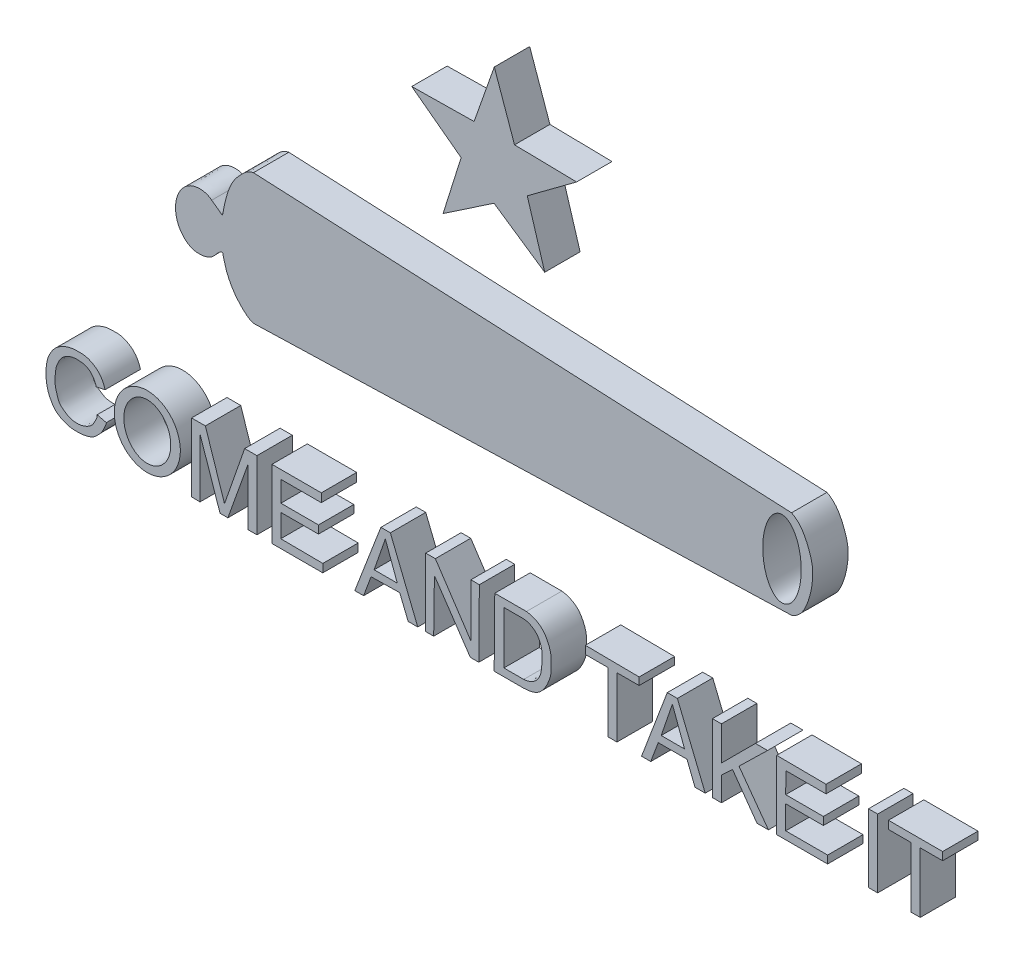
from build123d import *

# Parameters (mm, degrees)
SKETCH1_RX             = 2.551312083
SKETCH1_RY             = 2.369787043
SKETCH1_RX_2           = 1.980354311
SKETCH1_RY_2           = 1.684192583
BOSS_EXTRUDE1_DEPTH    = 2.54
BOSS_EXTRUDE1_2_DEPTH  = 2.54
SKETCH1_RX_3           = 2.74478041
SKETCH1_RY_3           = 1.381236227
BOSS_EXTRUDE1_3_DEPTH  = 2.54
BOSS_EXTRUDE1_4_DEPTH  = 2.54
BOSS_EXTRUDE1_5_DEPTH  = 2.54
BOSS_EXTRUDE1_6_DEPTH  = 2.54
BOSS_EXTRUDE1_7_DEPTH  = 2.54
BOSS_EXTRUDE1_8_DEPTH  = 2.54
BOSS_EXTRUDE1_9_DEPTH  = 2.54
BOSS_EXTRUDE1_10_DEPTH = 2.54
BOSS_EXTRUDE1_11_DEPTH = 2.54
SKETCH1_W              = 0.657390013
SKETCH1_H              = 4.900637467
BOSS_EXTRUDE1_12_DEPTH = 2.54
BOSS_EXTRUDE1_13_DEPTH = 2.54
BOSS_EXTRUDE1_14_DEPTH = 2.54
BOSS_EXTRUDE1_15_DEPTH = 2.54


with BuildPart() as part:
    # Sketch1 → Boss-Extrude1 (new body)
    with BuildSketch(Plane.XY):
        with Locations(Location((13.205217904, 10.595789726), (0, 0, -89.433260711))):
            Ellipse(SKETCH1_RX, SKETCH1_RY)
        with Locations(Location((13.205217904, 10.595789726), (0, 0, 90))):
            Ellipse(SKETCH1_RX_2, SKETCH1_RY_2, mode=Mode.SUBTRACT)
    extrude(amount=BOSS_EXTRUDE1_DEPTH)


with BuildPart() as body_2:
    # Sketch1 → Boss-Extrude1 2 (new body)
    with BuildSketch(Plane.XY):
        Polygon((36.9951, 8.15543886), (36.3855, 8.15543886), (33.808016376, 11.949979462), (33.7566, 8.15543886), (33.1851, 8.15543886), (33.1851, 13.033458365), (33.875619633, 13.033458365), (36.425134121, 9.199588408), (36.425134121, 12.995348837), (37.0332, 12.995348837), align=None)
    extrude(amount=BOSS_EXTRUDE1_2_DEPTH)


with BuildPart() as body_3:
    # Sketch1 → Boss-Extrude1 3 (new body)
    with BuildSketch(Plane.XY):
        with BuildLine():
            Line((20.820013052, 30.492703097), (59.436, 28.664502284))
            add(Edge.make_bspline(
                [(59.436, 28.664502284), (60.063757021, 28.355208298), (60.593490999, 27.374839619), (60.95634062, 26.192563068), (60.961736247, 25.393804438), (60.88618573, 24.639917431), (60.570978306, 23.457415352), (60.091161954, 22.518147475), (59.436, 22.294073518)],
                knots=[0, 0, 0, 0, 0.273352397, 0.432750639, 0.499757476, 0.596869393, 0.739924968, 1, 1, 1, 1], degree=3))
            Line((59.436, 22.294073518), (20.820013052, 21.133749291))
            add(Edge.make_bspline(
                [(20.820013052, 21.133749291), (20.429748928, 21.267254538), (19.986582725, 21.682982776), (19.43464508, 22.330326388), (19.089450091, 22.917984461), (18.859571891, 23.468536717), (18.735092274, 23.937771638), (18.640300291, 24.253309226), (18.62299326, 24.431008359), (18.560656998, 24.416573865)],
                knots=[0, 0, 0, 0, 0.290562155, 0.431015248, 0.614235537, 0.780845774, 0.857481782, 0.970399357, 1, 1, 1, 1], degree=3))
            add(Edge.make_bspline(
                [(17.827982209, 27.285638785), (17.402363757, 27.632747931), (16.383138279, 27.663007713), (15.429782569, 26.712544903), (15.120514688, 25.529525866), (15.439155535, 24.30285604), (16.259422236, 23.536042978), (17.122412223, 23.472685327), (17.890577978, 23.69578515), (18.211075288, 24.204273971), (18.496600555, 24.429592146), (18.560656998, 24.416573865)],
                knots=[0, 0, 0, 0, 0.186788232, 0.296684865, 0.444061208, 0.588487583, 0.717633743, 0.799818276, 0.878908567, 0.97998571, 1, 1, 1, 1], degree=3))
            add(Edge.make_bspline(
                [(17.827982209, 27.285638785), (18.01261601, 27.150368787), (18.484211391, 26.828147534), (18.531157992, 26.75499302)],
                knots=[0, 0, 0, 0, 1, 1, 1, 1], degree=3))
            add(Edge.make_bspline(
                [(20.820013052, 30.492703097), (20.411672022, 30.427531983), (19.983730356, 30.000983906), (19.412218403, 29.352612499), (19.068460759, 28.667892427), (18.863250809, 27.989035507), (18.730853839, 27.417301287), (18.650350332, 26.978881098), (18.625602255, 26.806696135), (18.573752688, 26.732359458), (18.531157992, 26.75499302)],
                knots=[0, 0, 0, 0, 0.254599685, 0.380764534, 0.562119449, 0.748481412, 0.832757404, 0.962235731, 0.978959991, 1, 1, 1, 1], degree=3))
        make_face()
        with Locations(Location((58.752047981, 25.468536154), (0, 0, 90))):
            Ellipse(SKETCH1_RX_3, SKETCH1_RY_3, mode=Mode.SUBTRACT)
    extrude(amount=BOSS_EXTRUDE1_3_DEPTH)


with BuildPart() as body_4:
    # Sketch1 → Boss-Extrude1 4 (new body)
    with BuildSketch(Plane.XY):
        with BuildLine():
            Line((9.536653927, 11.541139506), (10.178564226, 11.681944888))
            add(Edge.make_bspline(
                [(10.178564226, 11.681944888), (10.083664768, 12.026131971), (9.810877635, 12.535974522), (9.228045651, 12.91281473), (8.746422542, 13.097881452), (8.215153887, 13.097828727), (7.649922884, 13.07032648), (7.138999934, 12.861221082), (6.675665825, 12.594327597), (6.335361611, 12.171990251), (6.062061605, 11.652484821), (5.955515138, 11.116613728), (5.926667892, 10.541490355), (5.957220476, 10.011309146), (6.09120418, 9.473841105), (6.312740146, 9.026807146), (6.559549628, 8.632055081), (6.91821454, 8.380033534), (7.24468731, 8.219306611), (7.668712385, 8.084521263), (8.179066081, 8.052713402), (8.696251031, 8.097887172), (9.106322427, 8.20700341), (9.434747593, 8.369023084), (9.69251421, 8.650969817), (9.970817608, 8.923799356), (10.110121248, 9.303025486), (10.260560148, 9.528437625), (10.264772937, 9.681519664)],
                knots=[0, 0, 0, 0, 0.082355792, 0.124488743, 0.156179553, 0.19866158, 0.244335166, 0.284260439, 0.323358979, 0.365023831, 0.405904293, 0.456461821, 0.487994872, 0.537350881, 0.577094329, 0.613307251, 0.65117169, 0.681527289, 0.711812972, 0.734115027, 0.782595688, 0.82723147, 0.852059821, 0.879250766, 0.909226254, 0.938728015, 0.966879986, 1, 1, 1, 1], degree=3))
            Line((10.264772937, 9.681519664), (9.606771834, 9.842936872))
            add(Edge.make_bspline(
                [(9.536653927, 11.541139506), (9.472293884, 11.871665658), (9.110151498, 12.429969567), (8.427791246, 12.562385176), (7.931127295, 12.56892518), (7.518898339, 12.448522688), (7.060460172, 12.154519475), (6.845542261, 11.784477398), (6.643875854, 11.334019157), (6.593419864, 10.79026513), (6.555568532, 10.246622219), (6.720500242, 9.68963946), (6.85759056, 9.192260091), (7.289359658, 8.860657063), (7.722828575, 8.604269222), (8.051115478, 8.588136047), (8.353844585, 8.585353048), (8.730053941, 8.670695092), (9.173305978, 8.909786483), (9.318155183, 9.119198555), (9.441708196, 9.328985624), (9.516836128, 9.467584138), (9.58211934, 9.62328874), (9.580461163, 9.59890387), (9.606771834, 9.842936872)],
                knots=[0, 0, 0, 0, 0.117046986, 0.1718132, 0.218544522, 0.265664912, 0.312288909, 0.367204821, 0.41497588, 0.459943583, 0.53723913, 0.580926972, 0.641016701, 0.690751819, 0.747004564, 0.787855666, 0.797323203, 0.841679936, 0.888080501, 0.932032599, 0.939190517, 0.957385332, 0.963693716, 1, 1, 1, 1], degree=3))
        make_face()
    extrude(amount=BOSS_EXTRUDE1_4_DEPTH)


with BuildPart() as body_5:
    # Sketch1 → Boss-Extrude1 5 (new body)
    with BuildSketch(Plane.XY):
        Polygon((17.371566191, 13.033458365), (18.7452, 8.87951988), (20.193, 13.033458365), (21.07145048, 13.033458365), (21.07145048, 8.112465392), (20.438863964, 8.112465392), (20.438863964, 12.195048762), (18.988599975, 8.126867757), (18.425156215, 8.126867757), (16.995934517, 12.312685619), (16.986020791, 8.112465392), (16.383, 8.126867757), (16.383, 13.033458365), align=None)
    extrude(amount=BOSS_EXTRUDE1_5_DEPTH)


with BuildPart() as body_6:
    # Sketch1 → Boss-Extrude1 6 (new body)
    with BuildSketch(Plane.XY):
        Polygon((22.150038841, 13.033458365), (25.692130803, 13.033458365), (25.692130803, 12.421556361), (22.791331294, 12.421556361), (22.791331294, 10.937434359), (25.4889, 10.937434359), (25.4889, 10.365791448), (22.7838, 10.365791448), (22.7838, 8.726016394), (25.800011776, 8.701335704), (25.800011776, 8.112465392), (22.150038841, 8.112465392), align=None)
    extrude(amount=BOSS_EXTRUDE1_6_DEPTH)


with BuildPart() as body_7:
    # Sketch1 → Boss-Extrude1 7 (new body)
    with BuildSketch(Plane.XY):
        Polygon((30.646787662, 13.025299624), (32.6136, 8.15543886), (31.926185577, 8.15543886), (31.3182, 9.641710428), (29.2608, 9.6036009), (28.7274, 8.15543886), (28.093748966, 8.15543886), (29.966567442, 13.025299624), align=None)
        Polygon((29.482546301, 10.14639838), (30.287536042, 12.461815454), (31.145748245, 10.14639838), align=None, mode=Mode.SUBTRACT)
    extrude(amount=BOSS_EXTRUDE1_7_DEPTH)


with BuildPart() as body_8:
    # Sketch1 → Boss-Extrude1 8 (new body)
    with BuildSketch(Plane.XY):
        Polygon((44.639775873, 13.033216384), (48.5013, 12.995348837), (48.5013, 12.461815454), (46.91015204, 12.461815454), (46.91015204, 8.154016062), (46.2534, 8.154016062), (46.2534, 12.461815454), (44.639775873, 12.461815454), align=None)
    extrude(amount=BOSS_EXTRUDE1_8_DEPTH)


with BuildPart() as body_9:
    # Sketch1 → Boss-Extrude1 9 (new body)
    with BuildSketch(Plane.XY):
        Polygon((51.243412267, 13.033458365), (53.243956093, 8.144427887), (52.51204163, 8.144427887), (51.936632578, 9.598343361), (49.869047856, 9.598343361), (49.33353789, 8.154016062), (48.672406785, 8.154016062), (50.5206, 13.033458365), align=None)
        Polygon((50.88609873, 12.499924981), (50.08210208, 10.14639838), (51.758660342, 10.14639838), align=None, mode=Mode.SUBTRACT)
    extrude(amount=BOSS_EXTRUDE1_9_DEPTH)


with BuildPart() as body_10:
    # Sketch1 → Boss-Extrude1 10 (new body)
    with BuildSketch(Plane.XY):
        Polygon((54.4068, 13.033458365), (54.4068, 10.596788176), (56.842676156, 13.033458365), (57.717403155, 13.033458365), (55.666718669, 11.03316156), (57.77811336, 8.129982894), (56.959110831, 8.129982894), (55.205229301, 10.596788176), (54.4068, 9.856986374), (54.4068, 8.125503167), (53.7591, 8.125503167), (53.7591, 13.033458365), align=None)
    extrude(amount=BOSS_EXTRUDE1_10_DEPTH)


with BuildPart() as body_11:
    # Sketch1 → Boss-Extrude1 11 (new body)
    with BuildSketch(Plane.XY):
        Polygon((58.3692, 13.059159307), (61.9125, 13.033458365), (61.9125, 12.433315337), (59.031482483, 12.433315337), (59.0169, 10.937434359), (61.722, 10.937434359), (61.722, 10.372076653), (59.016753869, 10.372076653), (59.016753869, 8.688972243), (62.0268, 8.688972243), (62.0268, 8.132820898), (58.3692, 8.129982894), align=None)
    extrude(amount=BOSS_EXTRUDE1_11_DEPTH)


with BuildPart() as body_12:
    # Sketch1 → Boss-Extrude1 12 (new body)
    with BuildSketch(Plane.XY):
        with Locations((65.289195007, 10.583139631)):
            Rectangle(SKETCH1_W, SKETCH1_H)
    extrude(amount=BOSS_EXTRUDE1_12_DEPTH)


with BuildPart() as body_13:
    # Sketch1 → Boss-Extrude1 13 (new body)
    with BuildSketch(Plane.XY):
        Polygon((66.39005405, 13.033458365), (70.277315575, 13.033458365), (70.277315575, 12.461815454), (68.672203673, 12.461815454), (68.672203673, 8.132820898), (68.002773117, 8.132820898), (68.002773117, 12.461815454), (66.39005405, 12.461815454), align=None)
    extrude(amount=BOSS_EXTRUDE1_13_DEPTH)


with BuildPart() as body_14:
    # Sketch1 → Boss-Extrude1 14 (new body)
    with BuildSketch(Plane.XY):
        Polygon((38.106206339, 45.706188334), (39.558418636, 41.592750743), (44.012438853, 41.5113499), (40.472170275, 38.881648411), (41.724435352, 34.756074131), (38.085983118, 37.22706163), (34.430177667, 34.756074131), (35.725416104, 38.881648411), (32.182576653, 41.530597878), (36.657110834, 41.592750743), align=None)
    extrude(amount=BOSS_EXTRUDE1_14_DEPTH)


with BuildPart() as body_15:
    # Sketch1 → Boss-Extrude1 15 (new body)
    with BuildSketch(Plane.XY):
        with BuildLine():
            Line((38.140601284, 13.017917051), (38.09676779, 8.1513728))
            Line((38.09676779, 8.1513728), (40.220567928, 8.1513728))
            add(Edge.make_bspline(
                [(40.412516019, 13.017917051), (40.838290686, 12.966683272), (41.505067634, 12.680081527), (41.982039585, 11.876557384), (42.198860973, 11.259892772), (42.178020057, 10.637200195), (42.212265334, 10.109860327), (42.04218908, 9.507474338), (41.763114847, 8.925547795), (41.201338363, 8.257999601), (40.562142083, 8.170063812), (40.220567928, 8.1513728)],
                knots=[0, 0, 0, 0, 0.191148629, 0.289803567, 0.402842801, 0.471550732, 0.561309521, 0.632461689, 0.742343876, 0.844349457, 1, 1, 1, 1], degree=3))
            Line((40.412516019, 13.017917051), (38.140601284, 13.017917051))
        make_face()
        with BuildLine():
            Line((40.220567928, 8.701335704), (38.796489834, 8.701335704))
            Line((38.796489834, 8.701335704), (38.796489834, 12.461815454))
            Line((38.796489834, 12.461815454), (40.220567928, 12.461815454))
            add(Edge.make_bspline(
                [(40.220567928, 12.461815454), (40.590475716, 12.430574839), (41.136456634, 12.136290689), (41.475631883, 11.448952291), (41.570232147, 10.846156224), (41.517032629, 10.232778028), (41.458791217, 9.573762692), (41.054768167, 8.911470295), (40.521458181, 8.719386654), (40.220567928, 8.701335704)],
                knots=[0, 0, 0, 0, 0.2165017, 0.331903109, 0.437469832, 0.570131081, 0.6918073, 0.821860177, 1, 1, 1, 1], degree=3))
        make_face(mode=Mode.SUBTRACT)
    extrude(amount=BOSS_EXTRUDE1_15_DEPTH)


solid = Compound([part.part, body_2.part, body_3.part, body_4.part, body_5.part, body_6.part, body_7.part, body_8.part, body_9.part, body_10.part, body_11.part, body_12.part, body_13.part, body_14.part, body_15.part])
